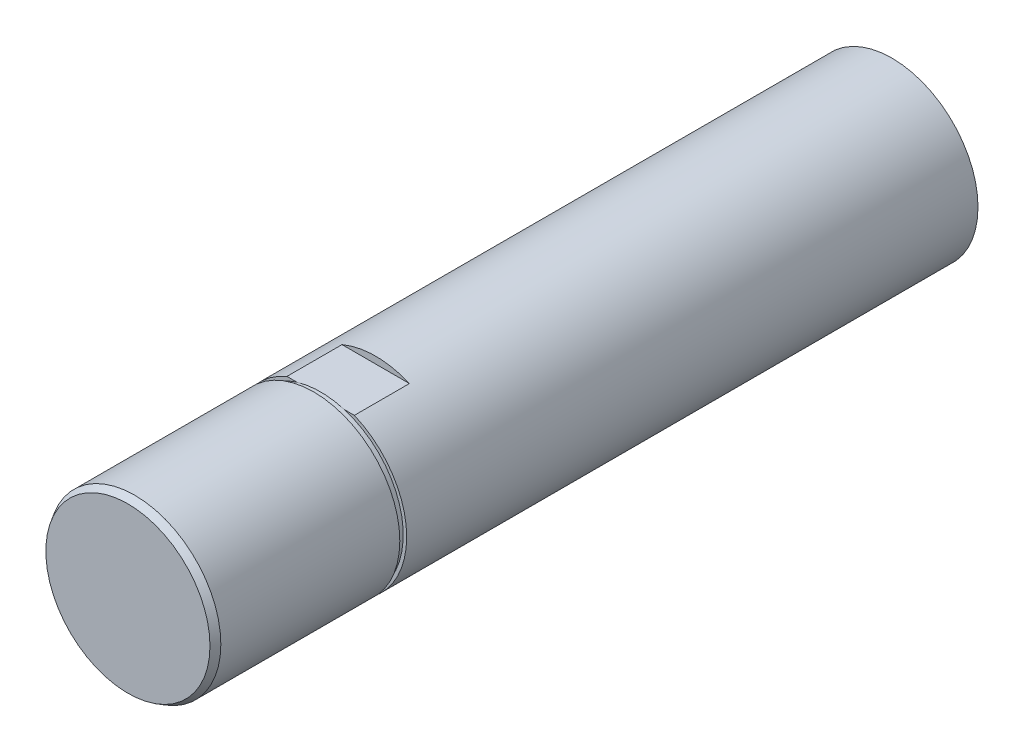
ISO-10303-21;
HEADER;
FILE_DESCRIPTION(('STEP AP214'),'2;1');
FILE_NAME('part.step','',(''),(''),'','','');
FILE_SCHEMA(('AUTOMOTIVE_DESIGN { 1 0 10303 214 1 1 1 1 }'));
ENDSEC;
DATA;
#1=APPLICATION_CONTEXT('core data for automotive mechanical design processes');
#2=APPLICATION_PROTOCOL_DEFINITION('international standard','automotive_design',2000,#1);
#3=PRODUCT_CONTEXT('',#1,'mechanical');
#4=PRODUCT('Part','Part','',(#3));
#5=PRODUCT_RELATED_PRODUCT_CATEGORY('part','',(#4));
#6=PRODUCT_DEFINITION_FORMATION('','',#4);
#7=PRODUCT_DEFINITION_CONTEXT('part definition',#1,'design');
#8=PRODUCT_DEFINITION('design','',#6,#7);
#9=PRODUCT_DEFINITION_SHAPE('','',#8);
#10=(LENGTH_UNIT() NAMED_UNIT(*) SI_UNIT(.MILLI.,.METRE.));
#11=(NAMED_UNIT(*) PLANE_ANGLE_UNIT() SI_UNIT($,.RADIAN.));
#12=(NAMED_UNIT(*) SI_UNIT($,.STERADIAN.) SOLID_ANGLE_UNIT());
#13=UNCERTAINTY_MEASURE_WITH_UNIT(LENGTH_MEASURE(1.E-05),#10,'distance_accuracy_value','');
#14=(GEOMETRIC_REPRESENTATION_CONTEXT(3) GLOBAL_UNCERTAINTY_ASSIGNED_CONTEXT((#13)) GLOBAL_UNIT_ASSIGNED_CONTEXT((#10,
#11,#12)) REPRESENTATION_CONTEXT('',''));
#15=CARTESIAN_POINT('',(0.,0.,0.));
#16=DIRECTION('',(0.,0.,1.));
#17=DIRECTION('',(1.,0.,0.));
#18=AXIS2_PLACEMENT_3D('',#15,#16,#17);
#19=CARTESIAN_POINT('',(0.,0.,8.));
#20=DIRECTION('',(0.,0.,1.));
#21=DIRECTION('',(1.,0.,0.));
#22=AXIS2_PLACEMENT_3D('',#19,#20,#21);
#23=PLANE('',#22);
#24=DIRECTION('',(1.,0.,0.));
#25=VECTOR('',#24,1.);
#26=CARTESIAN_POINT('',(-10.5,-11.5,8.));
#27=LINE('',#26,#25);
#28=CARTESIAN_POINT('',(3.42782730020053,-11.5,8.));
#29=VERTEX_POINT('',#28);
#30=CARTESIAN_POINT('',(4.89897948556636,-11.5,8.00000000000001));
#31=VERTEX_POINT('',#30);
#32=EDGE_CURVE('E100',#29,#31,#27,.T.);
#33=ORIENTED_EDGE('',*,*,#32,.T.);
#34=CARTESIAN_POINT('',(0.,0.,8.));
#35=DIRECTION('',(0.,0.,1.));
#36=DIRECTION('',(1.,0.,0.));
#37=AXIS2_PLACEMENT_3D('',#34,#35,#36);
#38=CIRCLE('',#37,12.5);
#39=CARTESIAN_POINT('',(4.89897948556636,11.5,8.00000000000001));
#40=VERTEX_POINT('',#39);
#41=EDGE_CURVE('E114',#31,#40,#38,.T.);
#42=ORIENTED_EDGE('',*,*,#41,.T.);
#43=DIRECTION('',(1.,0.,0.));
#44=VECTOR('',#43,1.);
#45=CARTESIAN_POINT('',(-10.5,11.5,8.00000000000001));
#46=LINE('',#45,#44);
#47=CARTESIAN_POINT('',(3.42782730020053,11.5,8.00000000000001));
#48=VERTEX_POINT('',#47);
#49=EDGE_CURVE('E148',#48,#40,#46,.T.);
#50=ORIENTED_EDGE('',*,*,#49,.F.);
#51=CARTESIAN_POINT('',(0.,0.,8.));
#52=DIRECTION('',(0.,0.,1.));
#53=DIRECTION('',(1.,0.,0.));
#54=AXIS2_PLACEMENT_3D('',#51,#52,#53);
#55=CIRCLE('',#54,12.);
#56=EDGE_CURVE('E142',#29,#48,#55,.T.);
#57=ORIENTED_EDGE('',*,*,#56,.F.);
#58=EDGE_LOOP('',(#33,#42,#50,#57));
#59=FACE_BOUND('',#58,.T.);
#60=ADVANCED_FACE('F37',(#59),#23,.T.);
#61=CARTESIAN_POINT('',(0.,0.,-75.));
#62=DIRECTION('',(0.,0.,1.));
#63=DIRECTION('',(1.,0.,0.));
#64=AXIS2_PLACEMENT_3D('',#61,#62,#63);
#65=CYLINDRICAL_SURFACE('',#64,12.5);
#66=CARTESIAN_POINT('',(0.,0.,9.));
#67=DIRECTION('',(0.,0.,1.));
#68=DIRECTION('',(1.,0.,0.));
#69=AXIS2_PLACEMENT_3D('',#66,#67,#68);
#70=CIRCLE('',#69,12.5);
#71=CARTESIAN_POINT('',(12.5,0.,9.));
#72=VERTEX_POINT('',#71);
#73=EDGE_CURVE('E113',#72,#72,#70,.T.);
#74=ORIENTED_EDGE('',*,*,#73,.T.);
#75=EDGE_LOOP('',(#74));
#76=FACE_BOUND('',#75,.T.);
#77=CARTESIAN_POINT('',(0.,0.,35.));
#78=DIRECTION('',(0.,0.,1.));
#79=DIRECTION('',(1.,0.,0.));
#80=AXIS2_PLACEMENT_3D('',#77,#78,#79);
#81=CIRCLE('',#80,12.5);
#82=CARTESIAN_POINT('',(12.5,0.,35.));
#83=VERTEX_POINT('',#82);
#84=EDGE_CURVE('E127',#83,#83,#81,.F.);
#85=ORIENTED_EDGE('',*,*,#84,.T.);
#86=EDGE_LOOP('',(#85));
#87=FACE_BOUND('',#86,.T.);
#88=ADVANCED_FACE('F178',(#76,#87),#65,.T.);
#89=CARTESIAN_POINT('',(0.,0.,36.));
#90=DIRECTION('',(0.,0.,1.));
#91=DIRECTION('',(1.,0.,0.));
#92=AXIS2_PLACEMENT_3D('',#89,#90,#91);
#93=PLANE('',#92);
#94=CARTESIAN_POINT('',(0.,0.,36.));
#95=DIRECTION('',(0.,0.,1.));
#96=DIRECTION('',(1.,0.,0.));
#97=AXIS2_PLACEMENT_3D('',#94,#95,#96);
#98=CIRCLE('',#97,11.9226497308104);
#99=CARTESIAN_POINT('',(11.9226497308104,0.,36.));
#100=VERTEX_POINT('',#99);
#101=EDGE_CURVE('E124',#100,#100,#98,.T.);
#102=ORIENTED_EDGE('',*,*,#101,.T.);
#103=EDGE_LOOP('',(#102));
#104=FACE_BOUND('',#103,.T.);
#105=ADVANCED_FACE('F183',(#104),#93,.T.);
#106=CARTESIAN_POINT('',(0.,0.,36.));
#107=DIRECTION('',(0.,0.,-1.));
#108=DIRECTION('',(-1.,0.,0.));
#109=AXIS2_PLACEMENT_3D('',#106,#107,#108);
#110=CONICAL_SURFACE('',#109,11.9226497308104,0.523598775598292);
#111=ORIENTED_EDGE('',*,*,#84,.F.);
#112=EDGE_LOOP('',(#111));
#113=FACE_BOUND('',#112,.T.);
#114=ORIENTED_EDGE('',*,*,#101,.F.);
#115=EDGE_LOOP('',(#114));
#116=FACE_BOUND('',#115,.T.);
#117=ADVANCED_FACE('F39',(#113,#116),#110,.T.);
#118=CARTESIAN_POINT('',(0.,0.,9.));
#119=DIRECTION('',(0.,0.,1.));
#120=DIRECTION('',(1.,0.,0.));
#121=AXIS2_PLACEMENT_3D('',#118,#119,#120);
#122=PLANE('',#121);
#123=ORIENTED_EDGE('',*,*,#73,.F.);
#124=EDGE_LOOP('',(#123));
#125=FACE_BOUND('',#124,.T.);
#126=CARTESIAN_POINT('',(0.,0.,9.));
#127=DIRECTION('',(0.,0.,1.));
#128=DIRECTION('',(1.,0.,0.));
#129=AXIS2_PLACEMENT_3D('',#126,#127,#128);
#130=CIRCLE('',#129,12.);
#131=CARTESIAN_POINT('',(12.,0.,9.));
#132=VERTEX_POINT('',#131);
#133=EDGE_CURVE('E119',#132,#132,#130,.T.);
#134=ORIENTED_EDGE('',*,*,#133,.T.);
#135=EDGE_LOOP('',(#134));
#136=FACE_BOUND('',#135,.T.);
#137=ADVANCED_FACE('F188',(#125,#136),#122,.F.);
#138=CARTESIAN_POINT('',(-4.89897948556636,-11.5,8.00000000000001));
#139=VERTEX_POINT('',#138);
#140=CARTESIAN_POINT('',(-3.42782730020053,-11.5,8.));
#141=VERTEX_POINT('',#140);
#142=EDGE_CURVE('E89',#139,#141,#27,.T.);
#143=ORIENTED_EDGE('',*,*,#142,.T.);
#144=CARTESIAN_POINT('',(-3.42782730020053,11.5,8.00000000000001));
#145=VERTEX_POINT('',#144);
#146=EDGE_CURVE('E152',#145,#141,#55,.T.);
#147=ORIENTED_EDGE('',*,*,#146,.F.);
#148=CARTESIAN_POINT('',(-4.89897948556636,11.5,8.00000000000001));
#149=VERTEX_POINT('',#148);
#150=EDGE_CURVE('E112',#149,#145,#46,.T.);
#151=ORIENTED_EDGE('',*,*,#150,.F.);
#152=EDGE_CURVE('E106',#149,#139,#38,.T.);
#153=ORIENTED_EDGE('',*,*,#152,.T.);
#154=EDGE_LOOP('',(#143,#147,#151,#153));
#155=FACE_BOUND('',#154,.T.);
#156=ADVANCED_FACE('F110',(#155),#23,.T.);
#157=CARTESIAN_POINT('',(0.,0.,9.));
#158=DIRECTION('',(0.,0.,-1.));
#159=DIRECTION('',(-1.,0.,0.));
#160=AXIS2_PLACEMENT_3D('',#157,#158,#159);
#161=CYLINDRICAL_SURFACE('',#160,12.);
#162=ORIENTED_EDGE('',*,*,#133,.F.);
#163=EDGE_LOOP('',(#162));
#164=FACE_BOUND('',#163,.T.);
#165=EDGE_CURVE('E153',#48,#145,#55,.T.);
#166=ORIENTED_EDGE('',*,*,#165,.T.);
#167=ORIENTED_EDGE('',*,*,#146,.T.);
#168=CARTESIAN_POINT('',(0.,0.,8.));
#169=DIRECTION('',(0.,0.,1.));
#170=DIRECTION('',(1.,0.,0.));
#171=AXIS2_PLACEMENT_3D('',#168,#169,#170);
#172=CIRCLE('',#171,12.);
#173=EDGE_CURVE('E157',#141,#29,#172,.T.);
#174=ORIENTED_EDGE('',*,*,#173,.T.);
#175=ORIENTED_EDGE('',*,*,#56,.T.);
#176=EDGE_LOOP('',(#166,#167,#174,#175));
#177=FACE_BOUND('',#176,.T.);
#178=ADVANCED_FACE('F163',(#164,#177),#161,.T.);
#179=CARTESIAN_POINT('',(0.,0.,-75.));
#180=DIRECTION('',(0.,0.,1.));
#181=DIRECTION('',(1.,0.,0.));
#182=AXIS2_PLACEMENT_3D('',#179,#180,#181);
#183=PLANE('',#182);
#184=CARTESIAN_POINT('',(0.,0.,-75.));
#185=DIRECTION('',(0.,0.,1.));
#186=DIRECTION('',(1.,0.,0.));
#187=AXIS2_PLACEMENT_3D('',#184,#185,#186);
#188=CIRCLE('',#187,12.5);
#189=CARTESIAN_POINT('',(12.5,0.,-75.));
#190=VERTEX_POINT('',#189);
#191=EDGE_CURVE('E117',#190,#190,#188,.T.);
#192=ORIENTED_EDGE('',*,*,#191,.F.);
#193=EDGE_LOOP('',(#192));
#194=FACE_BOUND('',#193,.T.);
#195=ADVANCED_FACE('F193',(#194),#183,.F.);
#196=DIRECTION('',(0.,0.,1.));
#197=VECTOR('',#196,1.);
#198=CARTESIAN_POINT('',(-4.89897948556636,-11.5,-75.));
#199=LINE('',#198,#197);
#200=CARTESIAN_POINT('',(-4.89897948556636,-11.5,0.));
#201=VERTEX_POINT('',#200);
#202=EDGE_CURVE('E11',#139,#201,#199,.F.);
#203=ORIENTED_EDGE('',*,*,#202,.F.);
#204=ORIENTED_EDGE('',*,*,#152,.F.);
#205=DIRECTION('',(0.,0.,1.));
#206=VECTOR('',#205,1.);
#207=CARTESIAN_POINT('',(-4.89897948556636,11.5,-75.));
#208=LINE('',#207,#206);
#209=CARTESIAN_POINT('',(-4.89897948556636,11.5,0.));
#210=VERTEX_POINT('',#209);
#211=EDGE_CURVE('E130',#210,#149,#208,.T.);
#212=ORIENTED_EDGE('',*,*,#211,.F.);
#213=CARTESIAN_POINT('',(0.,0.,0.));
#214=DIRECTION('',(0.,0.,-1.));
#215=DIRECTION('',(-1.,0.,0.));
#216=AXIS2_PLACEMENT_3D('',#213,#214,#215);
#217=CIRCLE('',#216,12.5);
#218=CARTESIAN_POINT('',(4.89897948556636,11.5,0.));
#219=VERTEX_POINT('',#218);
#220=EDGE_CURVE('E132',#219,#210,#217,.F.);
#221=ORIENTED_EDGE('',*,*,#220,.F.);
#222=DIRECTION('',(0.,0.,1.));
#223=VECTOR('',#222,1.);
#224=CARTESIAN_POINT('',(4.89897948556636,11.5,-75.));
#225=LINE('',#224,#223);
#226=EDGE_CURVE('E134',#40,#219,#225,.F.);
#227=ORIENTED_EDGE('',*,*,#226,.F.);
#228=ORIENTED_EDGE('',*,*,#41,.F.);
#229=DIRECTION('',(0.,0.,1.));
#230=VECTOR('',#229,1.);
#231=CARTESIAN_POINT('',(4.89897948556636,-11.5,-75.));
#232=LINE('',#231,#230);
#233=CARTESIAN_POINT('',(4.89897948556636,-11.5,0.));
#234=VERTEX_POINT('',#233);
#235=EDGE_CURVE('E45',#234,#31,#232,.T.);
#236=ORIENTED_EDGE('',*,*,#235,.F.);
#237=CARTESIAN_POINT('',(0.,0.,0.));
#238=DIRECTION('',(0.,0.,-1.));
#239=DIRECTION('',(-1.,0.,0.));
#240=AXIS2_PLACEMENT_3D('',#237,#238,#239);
#241=CIRCLE('',#240,12.5);
#242=EDGE_CURVE('E108',#201,#234,#241,.F.);
#243=ORIENTED_EDGE('',*,*,#242,.F.);
#244=EDGE_LOOP('',(#203,#204,#212,#221,#227,#228,#236,#243));
#245=FACE_BOUND('',#244,.T.);
#246=ORIENTED_EDGE('',*,*,#191,.T.);
#247=EDGE_LOOP('',(#246));
#248=FACE_BOUND('',#247,.T.);
#249=ADVANCED_FACE('F103',(#245,#248),#65,.T.);
#250=CARTESIAN_POINT('',(-10.5,13.,8.00000000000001));
#251=DIRECTION('',(0.,0.,1.));
#252=DIRECTION('',(1.,0.,0.));
#253=AXIS2_PLACEMENT_3D('',#250,#251,#252);
#254=PLANE('',#253);
#255=EDGE_CURVE('E154',#145,#48,#46,.T.);
#256=ORIENTED_EDGE('',*,*,#255,.F.);
#257=ORIENTED_EDGE('',*,*,#165,.F.);
#258=EDGE_LOOP('',(#256,#257));
#259=FACE_BOUND('',#258,.T.);
#260=ADVANCED_FACE('F204',(#259),#254,.F.);
#261=CARTESIAN_POINT('',(-10.5,13.,0.));
#262=DIRECTION('',(0.,0.,-1.));
#263=DIRECTION('',(-1.,0.,0.));
#264=AXIS2_PLACEMENT_3D('',#261,#262,#263);
#265=PLANE('',#264);
#266=ORIENTED_EDGE('',*,*,#220,.T.);
#267=DIRECTION('',(1.,0.,0.));
#268=VECTOR('',#267,1.);
#269=CARTESIAN_POINT('',(-10.5,11.5,0.));
#270=LINE('',#269,#268);
#271=EDGE_CURVE('E58',#210,#219,#270,.T.);
#272=ORIENTED_EDGE('',*,*,#271,.T.);
#273=EDGE_LOOP('',(#266,#272));
#274=FACE_BOUND('',#273,.T.);
#275=ADVANCED_FACE('F150',(#274),#265,.F.);
#276=CARTESIAN_POINT('',(-10.5,11.5,8.00000000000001));
#277=DIRECTION('',(0.,-1.,0.));
#278=DIRECTION('',(0.,0.,-1.));
#279=AXIS2_PLACEMENT_3D('',#276,#277,#278);
#280=PLANE('',#279);
#281=ORIENTED_EDGE('',*,*,#226,.T.);
#282=ORIENTED_EDGE('',*,*,#271,.F.);
#283=ORIENTED_EDGE('',*,*,#211,.T.);
#284=ORIENTED_EDGE('',*,*,#150,.T.);
#285=ORIENTED_EDGE('',*,*,#255,.T.);
#286=ORIENTED_EDGE('',*,*,#49,.T.);
#287=EDGE_LOOP('',(#281,#282,#283,#284,#285,#286));
#288=FACE_BOUND('',#287,.T.);
#289=ADVANCED_FACE('F146',(#288),#280,.F.);
#290=CARTESIAN_POINT('',(-10.5,-11.5,8.));
#291=DIRECTION('',(0.,0.,1.));
#292=DIRECTION('',(1.,0.,0.));
#293=AXIS2_PLACEMENT_3D('',#290,#291,#292);
#294=PLANE('',#293);
#295=EDGE_CURVE('E94',#141,#29,#27,.T.);
#296=ORIENTED_EDGE('',*,*,#295,.T.);
#297=ORIENTED_EDGE('',*,*,#173,.F.);
#298=EDGE_LOOP('',(#296,#297));
#299=FACE_BOUND('',#298,.T.);
#300=ADVANCED_FACE('F166',(#299),#294,.F.);
#301=CARTESIAN_POINT('',(-10.5,-11.5,8.));
#302=DIRECTION('',(0.,1.,0.));
#303=DIRECTION('',(0.,0.,1.));
#304=AXIS2_PLACEMENT_3D('',#301,#302,#303);
#305=PLANE('',#304);
#306=ORIENTED_EDGE('',*,*,#202,.T.);
#307=DIRECTION('',(1.,0.,0.));
#308=VECTOR('',#307,1.);
#309=CARTESIAN_POINT('',(-10.5,-11.5,0.));
#310=LINE('',#309,#308);
#311=EDGE_CURVE('E51',#201,#234,#310,.T.);
#312=ORIENTED_EDGE('',*,*,#311,.T.);
#313=ORIENTED_EDGE('',*,*,#235,.T.);
#314=ORIENTED_EDGE('',*,*,#32,.F.);
#315=ORIENTED_EDGE('',*,*,#295,.F.);
#316=ORIENTED_EDGE('',*,*,#142,.F.);
#317=EDGE_LOOP('',(#306,#312,#313,#314,#315,#316));
#318=FACE_BOUND('',#317,.T.);
#319=ADVANCED_FACE('F91',(#318),#305,.F.);
#320=CARTESIAN_POINT('',(-10.5,-11.5,0.));
#321=DIRECTION('',(0.,0.,-1.));
#322=DIRECTION('',(-1.,0.,0.));
#323=AXIS2_PLACEMENT_3D('',#320,#321,#322);
#324=PLANE('',#323);
#325=ORIENTED_EDGE('',*,*,#242,.T.);
#326=ORIENTED_EDGE('',*,*,#311,.F.);
#327=EDGE_LOOP('',(#325,#326));
#328=FACE_BOUND('',#327,.T.);
#329=ADVANCED_FACE('F173',(#328),#324,.F.);
#330=CLOSED_SHELL('',(#60,#88,#105,#117,#137,#156,#178,#195,#249,#260,#275,#289,#300,#319,#329));
#331=MANIFOLD_SOLID_BREP('B2',#330);
#332=ADVANCED_BREP_SHAPE_REPRESENTATION('',(#18,#331),#14);
#333=SHAPE_DEFINITION_REPRESENTATION(#9,#332);
ENDSEC;
END-ISO-10303-21;
